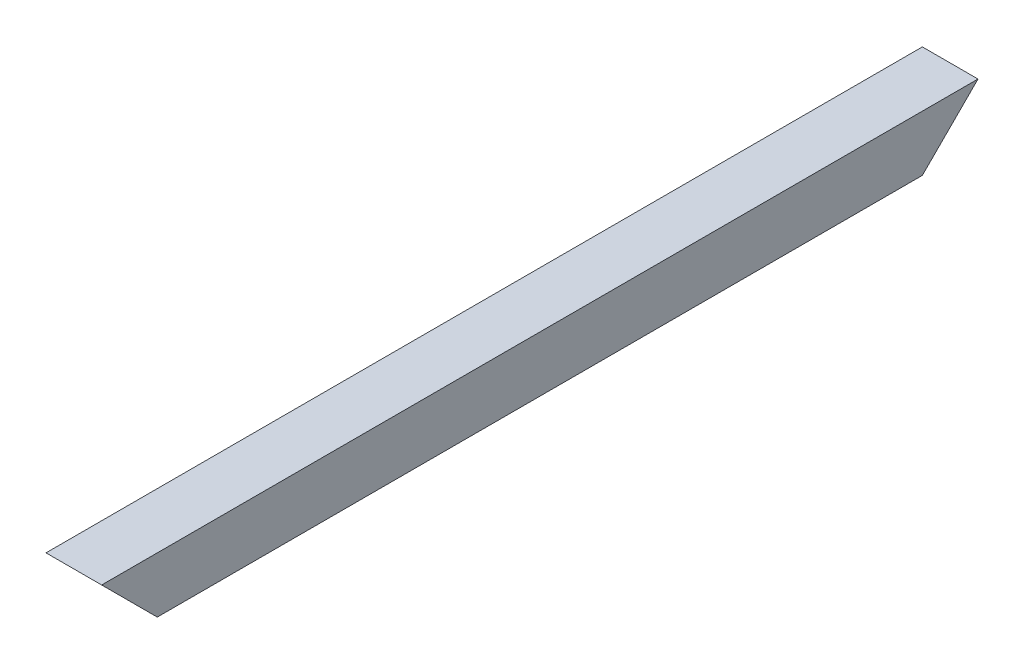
ISO-10303-21;
HEADER;
FILE_DESCRIPTION(('STEP AP214'),'2;1');
FILE_NAME('part.step','',(''),(''),'','','');
FILE_SCHEMA(('AUTOMOTIVE_DESIGN { 1 0 10303 214 1 1 1 1 }'));
ENDSEC;
DATA;
#1=APPLICATION_CONTEXT('core data for automotive mechanical design processes');
#2=APPLICATION_PROTOCOL_DEFINITION('international standard','automotive_design',2000,#1);
#3=PRODUCT_CONTEXT('',#1,'mechanical');
#4=PRODUCT('Part','Part','',(#3));
#5=PRODUCT_RELATED_PRODUCT_CATEGORY('part','',(#4));
#6=PRODUCT_DEFINITION_FORMATION('','',#4);
#7=PRODUCT_DEFINITION_CONTEXT('part definition',#1,'design');
#8=PRODUCT_DEFINITION('design','',#6,#7);
#9=PRODUCT_DEFINITION_SHAPE('','',#8);
#10=(LENGTH_UNIT() NAMED_UNIT(*) SI_UNIT(.MILLI.,.METRE.));
#11=(NAMED_UNIT(*) PLANE_ANGLE_UNIT() SI_UNIT($,.RADIAN.));
#12=(NAMED_UNIT(*) SI_UNIT($,.STERADIAN.) SOLID_ANGLE_UNIT());
#13=UNCERTAINTY_MEASURE_WITH_UNIT(LENGTH_MEASURE(1.E-05),#10,'distance_accuracy_value','');
#14=(GEOMETRIC_REPRESENTATION_CONTEXT(3) GLOBAL_UNCERTAINTY_ASSIGNED_CONTEXT((#13)) GLOBAL_UNIT_ASSIGNED_CONTEXT((#10,
#11,#12)) REPRESENTATION_CONTEXT('',''));
#15=CARTESIAN_POINT('',(0.,0.,0.));
#16=DIRECTION('',(0.,0.,1.));
#17=DIRECTION('',(1.,0.,0.));
#18=AXIS2_PLACEMENT_3D('',#15,#16,#17);
#19=CARTESIAN_POINT('',(0.,80.,1260.));
#20=DIRECTION('',(1.,0.,0.));
#21=DIRECTION('',(0.,1.,0.));
#22=AXIS2_PLACEMENT_3D('',#19,#20,#21);
#23=PLANE('',#22);
#24=DIRECTION('',(0.,0.,-1.));
#25=VECTOR('',#24,1.);
#26=CARTESIAN_POINT('',(0.,80.,1260.));
#27=LINE('',#26,#25);
#28=CARTESIAN_POINT('',(0.,80.,1260.));
#29=VERTEX_POINT('',#28);
#30=CARTESIAN_POINT('',(0.,80.,0.));
#31=VERTEX_POINT('',#30);
#32=EDGE_CURVE('E123',#29,#31,#27,.T.);
#33=ORIENTED_EDGE('',*,*,#32,.T.);
#34=DIRECTION('',(0.,0.707106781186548,-0.707106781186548));
#35=VECTOR('',#34,1.);
#36=CARTESIAN_POINT('',(0.,0.,80.0000000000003));
#37=LINE('',#36,#35);
#38=CARTESIAN_POINT('',(0.,0.,80.0000000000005));
#39=VERTEX_POINT('',#38);
#40=EDGE_CURVE('E11',#31,#39,#37,.F.);
#41=ORIENTED_EDGE('',*,*,#40,.T.);
#42=DIRECTION('',(0.,0.,-1.));
#43=VECTOR('',#42,1.);
#44=CARTESIAN_POINT('',(0.,0.,1260.));
#45=LINE('',#44,#43);
#46=CARTESIAN_POINT('',(0.,0.,1180.));
#47=VERTEX_POINT('',#46);
#48=EDGE_CURVE('E131',#47,#39,#45,.T.);
#49=ORIENTED_EDGE('',*,*,#48,.F.);
#50=DIRECTION('',(0.,0.707106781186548,0.707106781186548));
#51=VECTOR('',#50,1.);
#52=CARTESIAN_POINT('',(0.,80.0000000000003,1260.));
#53=LINE('',#52,#51);
#54=EDGE_CURVE('E139',#47,#29,#53,.T.);
#55=ORIENTED_EDGE('',*,*,#54,.T.);
#56=EDGE_LOOP('',(#33,#41,#49,#55));
#57=FACE_BOUND('',#56,.T.);
#58=ADVANCED_FACE('F32',(#57),#23,.F.);
#59=CARTESIAN_POINT('',(0.,0.,1260.));
#60=DIRECTION('',(0.,1.,0.));
#61=DIRECTION('',(0.,0.,1.));
#62=AXIS2_PLACEMENT_3D('',#59,#60,#61);
#63=PLANE('',#62);
#64=ORIENTED_EDGE('',*,*,#48,.T.);
#65=DIRECTION('',(1.,0.,0.));
#66=VECTOR('',#65,1.);
#67=CARTESIAN_POINT('',(0.,0.,80.0000000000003));
#68=LINE('',#67,#66);
#69=CARTESIAN_POINT('',(80.,0.,80.0000000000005));
#70=VERTEX_POINT('',#69);
#71=EDGE_CURVE('E142',#39,#70,#68,.T.);
#72=ORIENTED_EDGE('',*,*,#71,.T.);
#73=DIRECTION('',(0.,0.,-1.));
#74=VECTOR('',#73,1.);
#75=CARTESIAN_POINT('',(80.,0.,1260.));
#76=LINE('',#75,#74);
#77=CARTESIAN_POINT('',(80.,0.,1180.));
#78=VERTEX_POINT('',#77);
#79=EDGE_CURVE('E128',#78,#70,#76,.T.);
#80=ORIENTED_EDGE('',*,*,#79,.F.);
#81=DIRECTION('',(-1.,0.,0.));
#82=VECTOR('',#81,1.);
#83=CARTESIAN_POINT('',(0.,0.,1180.));
#84=LINE('',#83,#82);
#85=EDGE_CURVE('E136',#78,#47,#84,.T.);
#86=ORIENTED_EDGE('',*,*,#85,.T.);
#87=EDGE_LOOP('',(#64,#72,#80,#86));
#88=FACE_BOUND('',#87,.T.);
#89=ADVANCED_FACE('F186',(#88),#63,.F.);
#90=CARTESIAN_POINT('',(80.,80.,1260.));
#91=DIRECTION('',(-1.,0.,0.));
#92=DIRECTION('',(0.,-1.,0.));
#93=AXIS2_PLACEMENT_3D('',#90,#91,#92);
#94=PLANE('',#93);
#95=ORIENTED_EDGE('',*,*,#79,.T.);
#96=DIRECTION('',(0.,-0.707106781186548,0.707106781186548));
#97=VECTOR('',#96,1.);
#98=CARTESIAN_POINT('',(80.,0.,80.0000000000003));
#99=LINE('',#98,#97);
#100=CARTESIAN_POINT('',(80.,80.,0.));
#101=VERTEX_POINT('',#100);
#102=EDGE_CURVE('E42',#70,#101,#99,.F.);
#103=ORIENTED_EDGE('',*,*,#102,.T.);
#104=DIRECTION('',(0.,0.,-1.));
#105=VECTOR('',#104,1.);
#106=CARTESIAN_POINT('',(80.,80.,1260.));
#107=LINE('',#106,#105);
#108=CARTESIAN_POINT('',(80.,80.,1260.));
#109=VERTEX_POINT('',#108);
#110=EDGE_CURVE('E125',#109,#101,#107,.T.);
#111=ORIENTED_EDGE('',*,*,#110,.F.);
#112=DIRECTION('',(0.,-0.707106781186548,-0.707106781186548));
#113=VECTOR('',#112,1.);
#114=CARTESIAN_POINT('',(80.,80.0000000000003,1260.));
#115=LINE('',#114,#113);
#116=EDGE_CURVE('E133',#109,#78,#115,.T.);
#117=ORIENTED_EDGE('',*,*,#116,.T.);
#118=EDGE_LOOP('',(#95,#103,#111,#117));
#119=FACE_BOUND('',#118,.T.);
#120=ADVANCED_FACE('F152',(#119),#94,.F.);
#121=CARTESIAN_POINT('',(0.,80.,1260.));
#122=DIRECTION('',(0.,-1.,0.));
#123=DIRECTION('',(0.,0.,-1.));
#124=AXIS2_PLACEMENT_3D('',#121,#122,#123);
#125=PLANE('',#124);
#126=DIRECTION('',(-1.,0.,0.));
#127=VECTOR('',#126,1.);
#128=CARTESIAN_POINT('',(0.,80.,0.));
#129=LINE('',#128,#127);
#130=EDGE_CURVE('E90',#101,#31,#129,.T.);
#131=ORIENTED_EDGE('',*,*,#130,.T.);
#132=ORIENTED_EDGE('',*,*,#32,.F.);
#133=DIRECTION('',(-1.,0.,0.));
#134=VECTOR('',#133,1.);
#135=CARTESIAN_POINT('',(0.,80.,1260.));
#136=LINE('',#135,#134);
#137=EDGE_CURVE('E120',#109,#29,#136,.T.);
#138=ORIENTED_EDGE('',*,*,#137,.F.);
#139=ORIENTED_EDGE('',*,*,#110,.T.);
#140=EDGE_LOOP('',(#131,#132,#138,#139));
#141=FACE_BOUND('',#140,.T.);
#142=ADVANCED_FACE('F162',(#141),#125,.F.);
#143=CARTESIAN_POINT('',(3.,77.,1260.));
#144=DIRECTION('',(1.,0.,0.));
#145=DIRECTION('',(0.,1.,0.));
#146=AXIS2_PLACEMENT_3D('',#143,#144,#145);
#147=PLANE('',#146);
#148=DIRECTION('',(0.,0.707106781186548,-0.707106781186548));
#149=VECTOR('',#148,1.);
#150=CARTESIAN_POINT('',(3.,0.,80.0000000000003));
#151=LINE('',#150,#149);
#152=CARTESIAN_POINT('',(3.,77.,3.00000000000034));
#153=VERTEX_POINT('',#152);
#154=CARTESIAN_POINT('',(3.,3.,77.0000000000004));
#155=VERTEX_POINT('',#154);
#156=EDGE_CURVE('E82',#153,#155,#151,.F.);
#157=ORIENTED_EDGE('',*,*,#156,.F.);
#158=DIRECTION('',(0.,0.,-1.));
#159=VECTOR('',#158,1.);
#160=CARTESIAN_POINT('',(3.,77.,1260.));
#161=LINE('',#160,#159);
#162=CARTESIAN_POINT('',(3.,77.,1257.));
#163=VERTEX_POINT('',#162);
#164=EDGE_CURVE('E109',#163,#153,#161,.T.);
#165=ORIENTED_EDGE('',*,*,#164,.F.);
#166=DIRECTION('',(0.,-0.707106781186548,-0.707106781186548));
#167=VECTOR('',#166,1.);
#168=CARTESIAN_POINT('',(3.,78.5000000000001,1258.5));
#169=LINE('',#168,#167);
#170=CARTESIAN_POINT('',(3.,3.,1183.));
#171=VERTEX_POINT('',#170);
#172=EDGE_CURVE('E89',#163,#171,#169,.T.);
#173=ORIENTED_EDGE('',*,*,#172,.T.);
#174=DIRECTION('',(0.,0.,-1.));
#175=VECTOR('',#174,1.);
#176=CARTESIAN_POINT('',(3.,3.,1260.));
#177=LINE('',#176,#175);
#178=EDGE_CURVE('E76',#171,#155,#177,.T.);
#179=ORIENTED_EDGE('',*,*,#178,.T.);
#180=EDGE_LOOP('',(#157,#165,#173,#179));
#181=FACE_BOUND('',#180,.T.);
#182=ADVANCED_FACE('F85',(#181),#147,.T.);
#183=CARTESIAN_POINT('',(3.,3.,1260.));
#184=DIRECTION('',(0.,1.,0.));
#185=DIRECTION('',(0.,0.,1.));
#186=AXIS2_PLACEMENT_3D('',#183,#184,#185);
#187=PLANE('',#186);
#188=DIRECTION('',(-1.,0.,0.));
#189=VECTOR('',#188,1.);
#190=CARTESIAN_POINT('',(0.,3.,77.0000000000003));
#191=LINE('',#190,#189);
#192=CARTESIAN_POINT('',(77.,3.,77.0000000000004));
#193=VERTEX_POINT('',#192);
#194=EDGE_CURVE('E36',#155,#193,#191,.F.);
#195=ORIENTED_EDGE('',*,*,#194,.F.);
#196=ORIENTED_EDGE('',*,*,#178,.F.);
#197=DIRECTION('',(1.,0.,0.));
#198=VECTOR('',#197,1.);
#199=CARTESIAN_POINT('',(3.,3.,1183.));
#200=LINE('',#199,#198);
#201=CARTESIAN_POINT('',(77.,3.,1183.));
#202=VERTEX_POINT('',#201);
#203=EDGE_CURVE('E143',#171,#202,#200,.T.);
#204=ORIENTED_EDGE('',*,*,#203,.T.);
#205=DIRECTION('',(0.,0.,-1.));
#206=VECTOR('',#205,1.);
#207=CARTESIAN_POINT('',(77.,3.,1260.));
#208=LINE('',#207,#206);
#209=EDGE_CURVE('E70',#202,#193,#208,.T.);
#210=ORIENTED_EDGE('',*,*,#209,.T.);
#211=EDGE_LOOP('',(#195,#196,#204,#210));
#212=FACE_BOUND('',#211,.T.);
#213=ADVANCED_FACE('F75',(#212),#187,.T.);
#214=CARTESIAN_POINT('',(77.,77.,1260.));
#215=DIRECTION('',(-1.,0.,0.));
#216=DIRECTION('',(0.,-1.,0.));
#217=AXIS2_PLACEMENT_3D('',#214,#215,#216);
#218=PLANE('',#217);
#219=DIRECTION('',(0.,-0.707106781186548,0.707106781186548));
#220=VECTOR('',#219,1.);
#221=CARTESIAN_POINT('',(77.,0.,80.0000000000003));
#222=LINE('',#221,#220);
#223=CARTESIAN_POINT('',(77.,77.,3.00000000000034));
#224=VERTEX_POINT('',#223);
#225=EDGE_CURVE('E81',#193,#224,#222,.F.);
#226=ORIENTED_EDGE('',*,*,#225,.F.);
#227=ORIENTED_EDGE('',*,*,#209,.F.);
#228=DIRECTION('',(0.,0.707106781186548,0.707106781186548));
#229=VECTOR('',#228,1.);
#230=CARTESIAN_POINT('',(77.,78.5000000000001,1258.5));
#231=LINE('',#230,#229);
#232=CARTESIAN_POINT('',(77.,77.,1257.));
#233=VERTEX_POINT('',#232);
#234=EDGE_CURVE('E105',#202,#233,#231,.T.);
#235=ORIENTED_EDGE('',*,*,#234,.T.);
#236=DIRECTION('',(0.,0.,-1.));
#237=VECTOR('',#236,1.);
#238=CARTESIAN_POINT('',(77.,77.,1260.));
#239=LINE('',#238,#237);
#240=EDGE_CURVE('E104',#233,#224,#239,.T.);
#241=ORIENTED_EDGE('',*,*,#240,.T.);
#242=EDGE_LOOP('',(#226,#227,#235,#241));
#243=FACE_BOUND('',#242,.T.);
#244=ADVANCED_FACE('F99',(#243),#218,.T.);
#245=CARTESIAN_POINT('',(3.,77.,1260.));
#246=DIRECTION('',(0.,-1.,0.));
#247=DIRECTION('',(0.,0.,-1.));
#248=AXIS2_PLACEMENT_3D('',#245,#246,#247);
#249=PLANE('',#248);
#250=DIRECTION('',(1.,0.,0.));
#251=VECTOR('',#250,1.);
#252=CARTESIAN_POINT('',(0.,77.,3.00000000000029));
#253=LINE('',#252,#251);
#254=EDGE_CURVE('E94',#224,#153,#253,.F.);
#255=ORIENTED_EDGE('',*,*,#254,.F.);
#256=ORIENTED_EDGE('',*,*,#240,.F.);
#257=DIRECTION('',(-1.,0.,0.));
#258=VECTOR('',#257,1.);
#259=CARTESIAN_POINT('',(3.,77.,1257.));
#260=LINE('',#259,#258);
#261=EDGE_CURVE('E113',#233,#163,#260,.T.);
#262=ORIENTED_EDGE('',*,*,#261,.T.);
#263=ORIENTED_EDGE('',*,*,#164,.T.);
#264=EDGE_LOOP('',(#255,#256,#262,#263));
#265=FACE_BOUND('',#264,.T.);
#266=ADVANCED_FACE('F111',(#265),#249,.T.);
#267=CARTESIAN_POINT('',(0.,80.0000000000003,1260.));
#268=DIRECTION('',(0.,-0.707106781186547,0.707106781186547));
#269=DIRECTION('',(0.,-0.707106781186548,-0.707106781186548));
#270=AXIS2_PLACEMENT_3D('',#267,#268,#269);
#271=PLANE('',#270);
#272=ORIENTED_EDGE('',*,*,#54,.F.);
#273=ORIENTED_EDGE('',*,*,#85,.F.);
#274=ORIENTED_EDGE('',*,*,#116,.F.);
#275=ORIENTED_EDGE('',*,*,#137,.T.);
#276=EDGE_LOOP('',(#272,#273,#274,#275));
#277=FACE_BOUND('',#276,.T.);
#278=ORIENTED_EDGE('',*,*,#203,.F.);
#279=ORIENTED_EDGE('',*,*,#172,.F.);
#280=ORIENTED_EDGE('',*,*,#261,.F.);
#281=ORIENTED_EDGE('',*,*,#234,.F.);
#282=EDGE_LOOP('',(#278,#279,#280,#281));
#283=FACE_BOUND('',#282,.T.);
#284=ADVANCED_FACE('F175',(#277,#283),#271,.T.);
#285=CARTESIAN_POINT('',(0.,0.,80.0000000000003));
#286=DIRECTION('',(0.,0.707106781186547,0.707106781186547));
#287=DIRECTION('',(0.,-0.707106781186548,0.707106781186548));
#288=AXIS2_PLACEMENT_3D('',#285,#286,#287);
#289=PLANE('',#288);
#290=ORIENTED_EDGE('',*,*,#40,.F.);
#291=ORIENTED_EDGE('',*,*,#130,.F.);
#292=ORIENTED_EDGE('',*,*,#102,.F.);
#293=ORIENTED_EDGE('',*,*,#71,.F.);
#294=EDGE_LOOP('',(#290,#291,#292,#293));
#295=FACE_BOUND('',#294,.T.);
#296=ORIENTED_EDGE('',*,*,#156,.T.);
#297=ORIENTED_EDGE('',*,*,#194,.T.);
#298=ORIENTED_EDGE('',*,*,#225,.T.);
#299=ORIENTED_EDGE('',*,*,#254,.T.);
#300=EDGE_LOOP('',(#296,#297,#298,#299));
#301=FACE_BOUND('',#300,.T.);
#302=ADVANCED_FACE('F34',(#295,#301),#289,.F.);
#303=CLOSED_SHELL('',(#58,#89,#120,#142,#182,#213,#244,#266,#284,#302));
#304=MANIFOLD_SOLID_BREP('B2',#303);
#305=ADVANCED_BREP_SHAPE_REPRESENTATION('',(#18,#304),#14);
#306=SHAPE_DEFINITION_REPRESENTATION(#9,#305);
ENDSEC;
END-ISO-10303-21;
